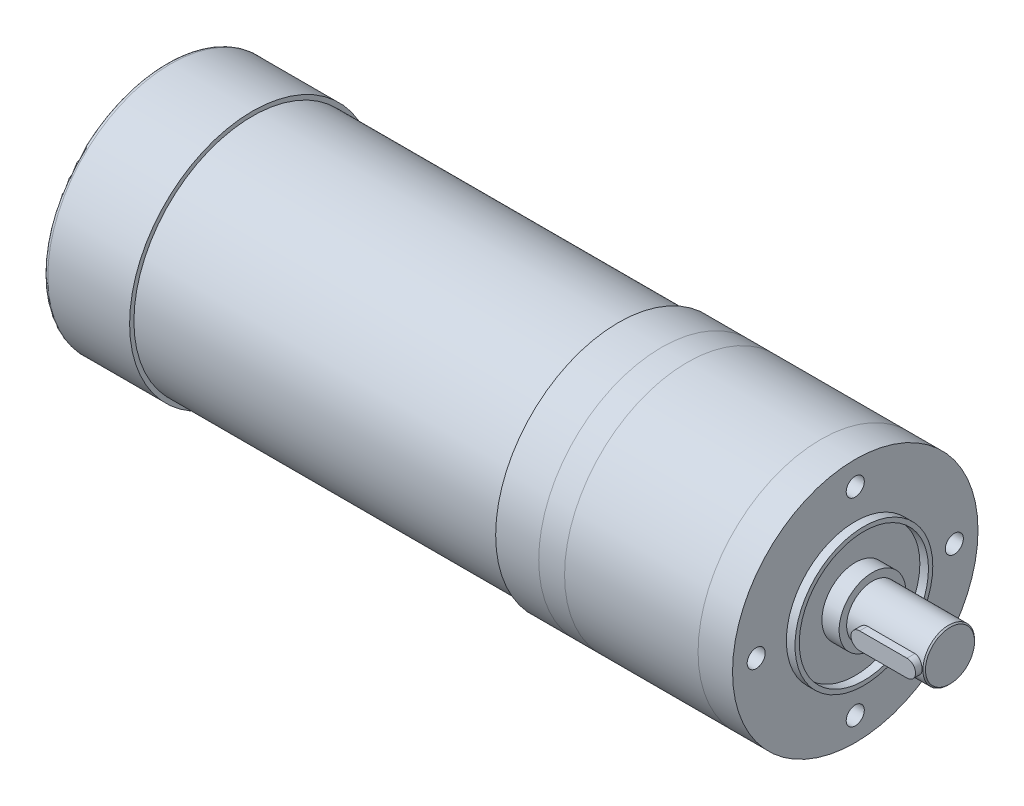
ISO-10303-21;
HEADER;
FILE_DESCRIPTION(('STEP AP214'),'2;1');
FILE_NAME('part.step','',(''),(''),'','','');
FILE_SCHEMA(('AUTOMOTIVE_DESIGN { 1 0 10303 214 1 1 1 1 }'));
ENDSEC;
DATA;
#1=APPLICATION_CONTEXT('core data for automotive mechanical design processes');
#2=APPLICATION_PROTOCOL_DEFINITION('international standard','automotive_design',2000,#1);
#3=PRODUCT_CONTEXT('',#1,'mechanical');
#4=PRODUCT('Part','Part','',(#3));
#5=PRODUCT_RELATED_PRODUCT_CATEGORY('part','',(#4));
#6=PRODUCT_DEFINITION_FORMATION('','',#4);
#7=PRODUCT_DEFINITION_CONTEXT('part definition',#1,'design');
#8=PRODUCT_DEFINITION('design','',#6,#7);
#9=PRODUCT_DEFINITION_SHAPE('','',#8);
#10=(LENGTH_UNIT() NAMED_UNIT(*) SI_UNIT(.MILLI.,.METRE.));
#11=(NAMED_UNIT(*) PLANE_ANGLE_UNIT() SI_UNIT($,.RADIAN.));
#12=(NAMED_UNIT(*) SI_UNIT($,.STERADIAN.) SOLID_ANGLE_UNIT());
#13=UNCERTAINTY_MEASURE_WITH_UNIT(LENGTH_MEASURE(1.E-05),#10,'distance_accuracy_value','');
#14=(GEOMETRIC_REPRESENTATION_CONTEXT(3) GLOBAL_UNCERTAINTY_ASSIGNED_CONTEXT((#13)) GLOBAL_UNIT_ASSIGNED_CONTEXT((#10,
#11,#12)) REPRESENTATION_CONTEXT('',''));
#15=CARTESIAN_POINT('',(0.,0.,0.));
#16=DIRECTION('',(0.,0.,1.));
#17=DIRECTION('',(1.,0.,0.));
#18=AXIS2_PLACEMENT_3D('',#15,#16,#17);
#19=CARTESIAN_POINT('',(8.5,0.,7.5));
#20=DIRECTION('',(0.,0.,-1.));
#21=DIRECTION('',(-1.,0.,0.));
#22=AXIS2_PLACEMENT_3D('',#19,#20,#21);
#23=CYLINDRICAL_SURFACE('',#22,2.);
#24=CARTESIAN_POINT('',(8.5,0.,3.5));
#25=DIRECTION('',(0.,0.,1.));
#26=DIRECTION('',(1.,0.,0.));
#27=AXIS2_PLACEMENT_3D('',#24,#25,#26);
#28=CIRCLE('',#27,2.);
#29=CARTESIAN_POINT('',(8.5,2.,3.5));
#30=VERTEX_POINT('',#29);
#31=CARTESIAN_POINT('',(8.5,-2.,3.5));
#32=VERTEX_POINT('',#31);
#33=EDGE_CURVE('E111',#30,#32,#28,.T.);
#34=ORIENTED_EDGE('',*,*,#33,.T.);
#35=DIRECTION('',(0.,0.,-1.));
#36=VECTOR('',#35,1.);
#37=CARTESIAN_POINT('',(8.5,-2.,7.5));
#38=LINE('',#37,#36);
#39=CARTESIAN_POINT('',(8.5,-2.,7.5));
#40=VERTEX_POINT('',#39);
#41=EDGE_CURVE('E12',#40,#32,#38,.T.);
#42=ORIENTED_EDGE('',*,*,#41,.F.);
#43=CARTESIAN_POINT('',(8.5,0.,7.5));
#44=DIRECTION('',(0.,0.,1.));
#45=DIRECTION('',(1.,0.,0.));
#46=AXIS2_PLACEMENT_3D('',#43,#44,#45);
#47=CIRCLE('',#46,2.);
#48=CARTESIAN_POINT('',(8.5,2.,7.5));
#49=VERTEX_POINT('',#48);
#50=EDGE_CURVE('E99',#49,#40,#47,.T.);
#51=ORIENTED_EDGE('',*,*,#50,.F.);
#52=DIRECTION('',(0.,0.,-1.));
#53=VECTOR('',#52,1.);
#54=CARTESIAN_POINT('',(8.5,2.,7.5));
#55=LINE('',#54,#53);
#56=EDGE_CURVE('E107',#49,#30,#55,.T.);
#57=ORIENTED_EDGE('',*,*,#56,.T.);
#58=EDGE_LOOP('',(#34,#42,#51,#57));
#59=FACE_BOUND('',#58,.T.);
#60=ADVANCED_FACE('F48',(#59),#23,.T.);
#61=CARTESIAN_POINT('',(19.5,-2.,7.5));
#62=DIRECTION('',(0.,1.,0.));
#63=DIRECTION('',(-1.,0.,0.));
#64=AXIS2_PLACEMENT_3D('',#61,#62,#63);
#65=PLANE('',#64);
#66=DIRECTION('',(1.,0.,0.));
#67=VECTOR('',#66,1.);
#68=CARTESIAN_POINT('',(19.5,-2.,3.5));
#69=LINE('',#68,#67);
#70=CARTESIAN_POINT('',(19.5,-2.,3.5));
#71=VERTEX_POINT('',#70);
#72=EDGE_CURVE('E103',#32,#71,#69,.T.);
#73=ORIENTED_EDGE('',*,*,#72,.T.);
#74=DIRECTION('',(0.,0.,-1.));
#75=VECTOR('',#74,1.);
#76=CARTESIAN_POINT('',(19.5,-2.,7.5));
#77=LINE('',#76,#75);
#78=CARTESIAN_POINT('',(19.5,-2.,7.5));
#79=VERTEX_POINT('',#78);
#80=EDGE_CURVE('E56',#79,#71,#77,.T.);
#81=ORIENTED_EDGE('',*,*,#80,.F.);
#82=DIRECTION('',(1.,0.,0.));
#83=VECTOR('',#82,1.);
#84=CARTESIAN_POINT('',(19.5,-2.,7.5));
#85=LINE('',#84,#83);
#86=EDGE_CURVE('E94',#40,#79,#85,.T.);
#87=ORIENTED_EDGE('',*,*,#86,.F.);
#88=ORIENTED_EDGE('',*,*,#41,.T.);
#89=EDGE_LOOP('',(#73,#81,#87,#88));
#90=FACE_BOUND('',#89,.T.);
#91=ADVANCED_FACE('F102',(#90),#65,.F.);
#92=CARTESIAN_POINT('',(19.5,0.,7.5));
#93=DIRECTION('',(0.,0.,-1.));
#94=DIRECTION('',(-1.,0.,0.));
#95=AXIS2_PLACEMENT_3D('',#92,#93,#94);
#96=CYLINDRICAL_SURFACE('',#95,2.);
#97=CARTESIAN_POINT('',(19.5,0.,3.5));
#98=DIRECTION('',(0.,0.,1.));
#99=DIRECTION('',(1.,0.,0.));
#100=AXIS2_PLACEMENT_3D('',#97,#98,#99);
#101=CIRCLE('',#100,2.);
#102=CARTESIAN_POINT('',(19.5,2.,3.5));
#103=VERTEX_POINT('',#102);
#104=EDGE_CURVE('E81',#71,#103,#101,.T.);
#105=ORIENTED_EDGE('',*,*,#104,.T.);
#106=DIRECTION('',(0.,0.,-1.));
#107=VECTOR('',#106,1.);
#108=CARTESIAN_POINT('',(19.5,2.,7.5));
#109=LINE('',#108,#107);
#110=CARTESIAN_POINT('',(19.5,2.,7.5));
#111=VERTEX_POINT('',#110);
#112=EDGE_CURVE('E104',#111,#103,#109,.T.);
#113=ORIENTED_EDGE('',*,*,#112,.F.);
#114=CARTESIAN_POINT('',(19.5,0.,7.5));
#115=DIRECTION('',(0.,0.,1.));
#116=DIRECTION('',(1.,0.,0.));
#117=AXIS2_PLACEMENT_3D('',#114,#115,#116);
#118=CIRCLE('',#117,2.);
#119=EDGE_CURVE('E97',#79,#111,#118,.T.);
#120=ORIENTED_EDGE('',*,*,#119,.F.);
#121=ORIENTED_EDGE('',*,*,#80,.T.);
#122=EDGE_LOOP('',(#105,#113,#120,#121));
#123=FACE_BOUND('',#122,.T.);
#124=ADVANCED_FACE('F105',(#123),#96,.T.);
#125=CARTESIAN_POINT('',(8.5,2.,7.5));
#126=DIRECTION('',(0.,-1.,0.));
#127=DIRECTION('',(1.,0.,0.));
#128=AXIS2_PLACEMENT_3D('',#125,#126,#127);
#129=PLANE('',#128);
#130=DIRECTION('',(-1.,0.,0.));
#131=VECTOR('',#130,1.);
#132=CARTESIAN_POINT('',(8.5,2.,3.5));
#133=LINE('',#132,#131);
#134=EDGE_CURVE('E87',#103,#30,#133,.T.);
#135=ORIENTED_EDGE('',*,*,#134,.T.);
#136=ORIENTED_EDGE('',*,*,#56,.F.);
#137=DIRECTION('',(-1.,0.,0.));
#138=VECTOR('',#137,1.);
#139=CARTESIAN_POINT('',(8.5,2.,7.5));
#140=LINE('',#139,#138);
#141=EDGE_CURVE('E64',#111,#49,#140,.T.);
#142=ORIENTED_EDGE('',*,*,#141,.F.);
#143=ORIENTED_EDGE('',*,*,#112,.T.);
#144=EDGE_LOOP('',(#135,#136,#142,#143));
#145=FACE_BOUND('',#144,.T.);
#146=ADVANCED_FACE('F118',(#145),#129,.F.);
#147=CARTESIAN_POINT('',(8.5,0.,7.5));
#148=DIRECTION('',(0.,0.,1.));
#149=DIRECTION('',(1.,0.,0.));
#150=AXIS2_PLACEMENT_3D('',#147,#148,#149);
#151=PLANE('',#150);
#152=ORIENTED_EDGE('',*,*,#50,.T.);
#153=ORIENTED_EDGE('',*,*,#86,.T.);
#154=ORIENTED_EDGE('',*,*,#119,.T.);
#155=ORIENTED_EDGE('',*,*,#141,.T.);
#156=EDGE_LOOP('',(#152,#153,#154,#155));
#157=FACE_BOUND('',#156,.T.);
#158=ADVANCED_FACE('F95',(#157),#151,.T.);
#159=CARTESIAN_POINT('',(8.5,0.,3.5));
#160=DIRECTION('',(0.,0.,1.));
#161=DIRECTION('',(1.,0.,0.));
#162=AXIS2_PLACEMENT_3D('',#159,#160,#161);
#163=PLANE('',#162);
#164=ORIENTED_EDGE('',*,*,#33,.F.);
#165=ORIENTED_EDGE('',*,*,#134,.F.);
#166=ORIENTED_EDGE('',*,*,#104,.F.);
#167=ORIENTED_EDGE('',*,*,#72,.F.);
#168=EDGE_LOOP('',(#164,#165,#166,#167));
#169=FACE_BOUND('',#168,.T.);
#170=ADVANCED_FACE('F121',(#169),#163,.F.);
#171=CLOSED_SHELL('',(#60,#91,#124,#146,#158,#170));
#172=MANIFOLD_SOLID_BREP('B2',#171);
#173=CARTESIAN_POINT('',(-55.,0.,0.));
#174=DIRECTION('',(-1.,0.,0.));
#175=DIRECTION('',(0.,0.,1.));
#176=AXIS2_PLACEMENT_3D('',#173,#174,#175);
#177=PLANE('',#176);
#178=CARTESIAN_POINT('',(-55.,0.,0.));
#179=DIRECTION('',(-1.,0.,0.));
#180=DIRECTION('',(0.,0.,1.));
#181=AXIS2_PLACEMENT_3D('',#178,#179,#180);
#182=CIRCLE('',#181,28.5);
#183=CARTESIAN_POINT('',(-55.,0.,28.5));
#184=VERTEX_POINT('',#183);
#185=EDGE_CURVE('E191',#184,#184,#182,.T.);
#186=ORIENTED_EDGE('',*,*,#185,.T.);
#187=EDGE_LOOP('',(#186));
#188=FACE_BOUND('',#187,.T.);
#189=CARTESIAN_POINT('',(-55.,0.,0.));
#190=DIRECTION('',(-1.,0.,0.));
#191=DIRECTION('',(0.,0.,1.));
#192=AXIS2_PLACEMENT_3D('',#189,#190,#191);
#193=CIRCLE('',#192,27.5);
#194=CARTESIAN_POINT('',(-55.,0.,27.5));
#195=VERTEX_POINT('',#194);
#196=EDGE_CURVE('E201',#195,#195,#193,.T.);
#197=ORIENTED_EDGE('',*,*,#196,.F.);
#198=EDGE_LOOP('',(#197));
#199=FACE_BOUND('',#198,.T.);
#200=ADVANCED_FACE('F180',(#188,#199),#177,.T.);
#201=CARTESIAN_POINT('',(-55.,0.,0.));
#202=DIRECTION('',(1.,0.,0.));
#203=DIRECTION('',(0.,0.,-1.));
#204=AXIS2_PLACEMENT_3D('',#201,#202,#203);
#205=CYLINDRICAL_SURFACE('',#204,28.5);
#206=ORIENTED_EDGE('',*,*,#185,.F.);
#207=EDGE_LOOP('',(#206));
#208=FACE_BOUND('',#207,.T.);
#209=CARTESIAN_POINT('',(-45.,0.,0.));
#210=DIRECTION('',(-1.,0.,0.));
#211=DIRECTION('',(0.,0.,1.));
#212=AXIS2_PLACEMENT_3D('',#209,#210,#211);
#213=CIRCLE('',#212,28.5);
#214=CARTESIAN_POINT('',(-45.,0.,28.5));
#215=VERTEX_POINT('',#214);
#216=EDGE_CURVE('E195',#215,#215,#213,.T.);
#217=ORIENTED_EDGE('',*,*,#216,.T.);
#218=EDGE_LOOP('',(#217));
#219=FACE_BOUND('',#218,.T.);
#220=ADVANCED_FACE('F226',(#208,#219),#205,.T.);
#221=CARTESIAN_POINT('',(-45.,0.,0.));
#222=DIRECTION('',(-1.,0.,0.));
#223=DIRECTION('',(0.,0.,1.));
#224=AXIS2_PLACEMENT_3D('',#221,#222,#223);
#225=PLANE('',#224);
#226=ORIENTED_EDGE('',*,*,#216,.F.);
#227=EDGE_LOOP('',(#226));
#228=FACE_BOUND('',#227,.T.);
#229=ADVANCED_FACE('F221',(#228),#225,.F.);
#230=CARTESIAN_POINT('',(-140.,0.,0.));
#231=DIRECTION('',(1.,0.,0.));
#232=DIRECTION('',(0.,0.,-1.));
#233=AXIS2_PLACEMENT_3D('',#230,#231,#232);
#234=CYLINDRICAL_SURFACE('',#233,27.5);
#235=CARTESIAN_POINT('',(-140.,0.,0.));
#236=DIRECTION('',(-1.,0.,0.));
#237=DIRECTION('',(0.,0.,1.));
#238=AXIS2_PLACEMENT_3D('',#235,#236,#237);
#239=CIRCLE('',#238,27.5);
#240=CARTESIAN_POINT('',(-140.,0.,27.5));
#241=VERTEX_POINT('',#240);
#242=EDGE_CURVE('E199',#241,#241,#239,.T.);
#243=ORIENTED_EDGE('',*,*,#242,.F.);
#244=EDGE_LOOP('',(#243));
#245=FACE_BOUND('',#244,.T.);
#246=ORIENTED_EDGE('',*,*,#196,.T.);
#247=EDGE_LOOP('',(#246));
#248=FACE_BOUND('',#247,.T.);
#249=ADVANCED_FACE('F215',(#245,#248),#234,.T.);
#250=CARTESIAN_POINT('',(-140.,0.,0.));
#251=DIRECTION('',(-1.,0.,0.));
#252=DIRECTION('',(0.,0.,1.));
#253=AXIS2_PLACEMENT_3D('',#250,#251,#252);
#254=PLANE('',#253);
#255=CARTESIAN_POINT('',(-140.,0.,0.));
#256=DIRECTION('',(-1.,0.,0.));
#257=DIRECTION('',(0.,0.,1.));
#258=AXIS2_PLACEMENT_3D('',#255,#256,#257);
#259=CIRCLE('',#258,28.5);
#260=CARTESIAN_POINT('',(-140.,0.,28.5));
#261=VERTEX_POINT('',#260);
#262=EDGE_CURVE('E204',#261,#261,#259,.T.);
#263=ORIENTED_EDGE('',*,*,#262,.F.);
#264=EDGE_LOOP('',(#263));
#265=FACE_BOUND('',#264,.T.);
#266=ORIENTED_EDGE('',*,*,#242,.T.);
#267=EDGE_LOOP('',(#266));
#268=FACE_BOUND('',#267,.T.);
#269=ADVANCED_FACE('F212',(#265,#268),#254,.F.);
#270=CARTESIAN_POINT('',(-160.,0.,0.));
#271=DIRECTION('',(1.,0.,0.));
#272=DIRECTION('',(0.,0.,-1.));
#273=AXIS2_PLACEMENT_3D('',#270,#271,#272);
#274=CYLINDRICAL_SURFACE('',#273,28.5);
#275=CARTESIAN_POINT('',(-159.,0.,0.));
#276=DIRECTION('',(-1.,0.,0.));
#277=DIRECTION('',(0.,0.,1.));
#278=AXIS2_PLACEMENT_3D('',#275,#276,#277);
#279=CIRCLE('',#278,28.5);
#280=CARTESIAN_POINT('',(-159.,0.,28.5));
#281=VERTEX_POINT('',#280);
#282=EDGE_CURVE('E47',#281,#281,#279,.F.);
#283=ORIENTED_EDGE('',*,*,#282,.T.);
#284=EDGE_LOOP('',(#283));
#285=FACE_BOUND('',#284,.T.);
#286=ORIENTED_EDGE('',*,*,#262,.T.);
#287=EDGE_LOOP('',(#286));
#288=FACE_BOUND('',#287,.T.);
#289=ADVANCED_FACE('F210',(#285,#288),#274,.T.);
#290=CARTESIAN_POINT('',(-160.,0.,0.));
#291=DIRECTION('',(-1.,0.,0.));
#292=DIRECTION('',(0.,0.,1.));
#293=AXIS2_PLACEMENT_3D('',#290,#291,#292);
#294=PLANE('',#293);
#295=CARTESIAN_POINT('',(-160.,0.,0.));
#296=DIRECTION('',(-1.,0.,0.));
#297=DIRECTION('',(0.,0.,1.));
#298=AXIS2_PLACEMENT_3D('',#295,#296,#297);
#299=CIRCLE('',#298,27.5);
#300=CARTESIAN_POINT('',(-160.,0.,27.5));
#301=VERTEX_POINT('',#300);
#302=EDGE_CURVE('E187',#301,#301,#299,.T.);
#303=ORIENTED_EDGE('',*,*,#302,.T.);
#304=EDGE_LOOP('',(#303));
#305=FACE_BOUND('',#304,.T.);
#306=ADVANCED_FACE('F257',(#305),#294,.T.);
#307=CARTESIAN_POINT('',(-159.,0.,0.));
#308=DIRECTION('',(-1.,0.,0.));
#309=DIRECTION('',(0.,0.,1.));
#310=AXIS2_PLACEMENT_3D('',#307,#308,#309);
#311=TOROIDAL_SURFACE('',#310,27.5,1.);
#312=ORIENTED_EDGE('',*,*,#282,.F.);
#313=EDGE_LOOP('',(#312));
#314=FACE_BOUND('',#313,.T.);
#315=ORIENTED_EDGE('',*,*,#302,.F.);
#316=EDGE_LOOP('',(#315));
#317=FACE_BOUND('',#316,.T.);
#318=ADVANCED_FACE('F182',(#314,#317),#311,.T.);
#319=CLOSED_SHELL('',(#200,#220,#229,#249,#269,#289,#306,#318));
#320=MANIFOLD_SOLID_BREP('B6',#319);
#321=CARTESIAN_POINT('',(-45.,0.,0.));
#322=DIRECTION('',(1.,0.,0.));
#323=DIRECTION('',(0.,0.,-1.));
#324=AXIS2_PLACEMENT_3D('',#321,#322,#323);
#325=CYLINDRICAL_SURFACE('',#324,28.5);
#326=CARTESIAN_POINT('',(-45.,0.,0.));
#327=DIRECTION('',(-1.,0.,0.));
#328=DIRECTION('',(0.,0.,1.));
#329=AXIS2_PLACEMENT_3D('',#326,#327,#328);
#330=CIRCLE('',#329,28.5);
#331=CARTESIAN_POINT('',(-45.,0.,28.5));
#332=VERTEX_POINT('',#331);
#333=EDGE_CURVE('E179',#332,#332,#330,.T.);
#334=ORIENTED_EDGE('',*,*,#333,.F.);
#335=EDGE_LOOP('',(#334));
#336=FACE_BOUND('',#335,.T.);
#337=CARTESIAN_POINT('',(-39.,0.,0.));
#338=DIRECTION('',(-1.,0.,0.));
#339=DIRECTION('',(0.,0.,1.));
#340=AXIS2_PLACEMENT_3D('',#337,#338,#339);
#341=CIRCLE('',#340,28.5);
#342=CARTESIAN_POINT('',(-39.,0.,28.5));
#343=VERTEX_POINT('',#342);
#344=EDGE_CURVE('E309',#343,#343,#341,.T.);
#345=ORIENTED_EDGE('',*,*,#344,.T.);
#346=EDGE_LOOP('',(#345));
#347=FACE_BOUND('',#346,.T.);
#348=ADVANCED_FACE('F306',(#336,#347),#325,.T.);
#349=CARTESIAN_POINT('',(-45.,0.,0.));
#350=DIRECTION('',(-1.,0.,0.));
#351=DIRECTION('',(0.,0.,1.));
#352=AXIS2_PLACEMENT_3D('',#349,#350,#351);
#353=PLANE('',#352);
#354=ORIENTED_EDGE('',*,*,#333,.T.);
#355=EDGE_LOOP('',(#354));
#356=FACE_BOUND('',#355,.T.);
#357=ADVANCED_FACE('F321',(#356),#353,.T.);
#358=CARTESIAN_POINT('',(-39.,0.,0.));
#359=DIRECTION('',(-1.,0.,0.));
#360=DIRECTION('',(0.,0.,1.));
#361=AXIS2_PLACEMENT_3D('',#358,#359,#360);
#362=PLANE('',#361);
#363=ORIENTED_EDGE('',*,*,#344,.F.);
#364=EDGE_LOOP('',(#363));
#365=FACE_BOUND('',#364,.T.);
#366=ADVANCED_FACE('F319',(#365),#362,.F.);
#367=CLOSED_SHELL('',(#348,#357,#366));
#368=MANIFOLD_SOLID_BREP('B42',#367);
#369=CARTESIAN_POINT('',(-39.,0.,0.));
#370=DIRECTION('',(1.,0.,0.));
#371=DIRECTION('',(0.,0.,-1.));
#372=AXIS2_PLACEMENT_3D('',#369,#370,#371);
#373=CYLINDRICAL_SURFACE('',#372,28.5);
#374=CARTESIAN_POINT('',(-39.,0.,0.));
#375=DIRECTION('',(-1.,0.,0.));
#376=DIRECTION('',(0.,0.,1.));
#377=AXIS2_PLACEMENT_3D('',#374,#375,#376);
#378=CIRCLE('',#377,28.5);
#379=CARTESIAN_POINT('',(-39.,0.,28.5));
#380=VERTEX_POINT('',#379);
#381=EDGE_CURVE('E304',#380,#380,#378,.T.);
#382=ORIENTED_EDGE('',*,*,#381,.F.);
#383=EDGE_LOOP('',(#382));
#384=FACE_BOUND('',#383,.T.);
#385=CARTESIAN_POINT('',(-8.,0.,0.));
#386=DIRECTION('',(-1.,0.,0.));
#387=DIRECTION('',(0.,0.,1.));
#388=AXIS2_PLACEMENT_3D('',#385,#386,#387);
#389=CIRCLE('',#388,28.5);
#390=CARTESIAN_POINT('',(-8.,0.,28.5));
#391=VERTEX_POINT('',#390);
#392=EDGE_CURVE('E364',#391,#391,#389,.T.);
#393=ORIENTED_EDGE('',*,*,#392,.T.);
#394=EDGE_LOOP('',(#393));
#395=FACE_BOUND('',#394,.T.);
#396=ADVANCED_FACE('F356',(#384,#395),#373,.T.);
#397=CARTESIAN_POINT('',(-39.,0.,0.));
#398=DIRECTION('',(-1.,0.,0.));
#399=DIRECTION('',(0.,0.,1.));
#400=AXIS2_PLACEMENT_3D('',#397,#398,#399);
#401=PLANE('',#400);
#402=ORIENTED_EDGE('',*,*,#381,.T.);
#403=EDGE_LOOP('',(#402));
#404=FACE_BOUND('',#403,.T.);
#405=ADVANCED_FACE('F429',(#404),#401,.T.);
#406=CARTESIAN_POINT('',(-8.,0.,0.));
#407=DIRECTION('',(-1.,0.,0.));
#408=DIRECTION('',(0.,0.,1.));
#409=AXIS2_PLACEMENT_3D('',#406,#407,#408);
#410=PLANE('',#409);
#411=CARTESIAN_POINT('',(-8.,23.,0.));
#412=DIRECTION('',(-1.,0.,0.));
#413=DIRECTION('',(0.,0.,1.));
#414=AXIS2_PLACEMENT_3D('',#411,#412,#413);
#415=CIRCLE('',#414,2.1);
#416=CARTESIAN_POINT('',(-8.,23.,2.1));
#417=VERTEX_POINT('',#416);
#418=EDGE_CURVE('E359',#417,#417,#415,.T.);
#419=ORIENTED_EDGE('',*,*,#418,.T.);
#420=EDGE_LOOP('',(#419));
#421=FACE_BOUND('',#420,.T.);
#422=CARTESIAN_POINT('',(-8.,0.,-23.));
#423=DIRECTION('',(-1.,0.,0.));
#424=DIRECTION('',(0.,0.,1.));
#425=AXIS2_PLACEMENT_3D('',#422,#423,#424);
#426=CIRCLE('',#425,2.1);
#427=CARTESIAN_POINT('',(-8.,0.,-20.9));
#428=VERTEX_POINT('',#427);
#429=EDGE_CURVE('E393',#428,#428,#426,.T.);
#430=ORIENTED_EDGE('',*,*,#429,.T.);
#431=EDGE_LOOP('',(#430));
#432=FACE_BOUND('',#431,.T.);
#433=CARTESIAN_POINT('',(-8.,-23.,0.));
#434=DIRECTION('',(-1.,0.,0.));
#435=DIRECTION('',(0.,0.,1.));
#436=AXIS2_PLACEMENT_3D('',#433,#434,#435);
#437=CIRCLE('',#436,2.1);
#438=CARTESIAN_POINT('',(-8.,-23.,2.1));
#439=VERTEX_POINT('',#438);
#440=EDGE_CURVE('E397',#439,#439,#437,.T.);
#441=ORIENTED_EDGE('',*,*,#440,.T.);
#442=EDGE_LOOP('',(#441));
#443=FACE_BOUND('',#442,.T.);
#444=CARTESIAN_POINT('',(-8.,0.,23.));
#445=DIRECTION('',(-1.,0.,0.));
#446=DIRECTION('',(0.,0.,1.));
#447=AXIS2_PLACEMENT_3D('',#444,#445,#446);
#448=CIRCLE('',#447,2.1);
#449=CARTESIAN_POINT('',(-8.,0.,25.1));
#450=VERTEX_POINT('',#449);
#451=EDGE_CURVE('E400',#450,#450,#448,.T.);
#452=ORIENTED_EDGE('',*,*,#451,.T.);
#453=EDGE_LOOP('',(#452));
#454=FACE_BOUND('',#453,.T.);
#455=ORIENTED_EDGE('',*,*,#392,.F.);
#456=EDGE_LOOP('',(#455));
#457=FACE_BOUND('',#456,.T.);
#458=ADVANCED_FACE('F410',(#421,#432,#443,#454,#457),#410,.F.);
#459=CARTESIAN_POINT('',(0.,0.,23.));
#460=DIRECTION('',(1.,0.,0.));
#461=DIRECTION('',(0.,0.,-1.));
#462=AXIS2_PLACEMENT_3D('',#459,#460,#461);
#463=CYLINDRICAL_SURFACE('',#462,2.1);
#464=CARTESIAN_POINT('',(-14.,0.,23.));
#465=DIRECTION('',(1.,0.,0.));
#466=DIRECTION('',(0.,0.,-1.));
#467=AXIS2_PLACEMENT_3D('',#464,#465,#466);
#468=CIRCLE('',#467,2.1);
#469=CARTESIAN_POINT('',(-14.,0.,20.9));
#470=VERTEX_POINT('',#469);
#471=EDGE_CURVE('E398',#470,#470,#468,.T.);
#472=ORIENTED_EDGE('',*,*,#471,.F.);
#473=EDGE_LOOP('',(#472));
#474=FACE_BOUND('',#473,.T.);
#475=ORIENTED_EDGE('',*,*,#451,.F.);
#476=EDGE_LOOP('',(#475));
#477=FACE_BOUND('',#476,.T.);
#478=ADVANCED_FACE('F441',(#474,#477),#463,.F.);
#479=CARTESIAN_POINT('',(-14.,0.,23.));
#480=DIRECTION('',(1.,0.,0.));
#481=DIRECTION('',(0.,0.,-1.));
#482=AXIS2_PLACEMENT_3D('',#479,#480,#481);
#483=CONICAL_SURFACE('',#482,2.1,1.02974425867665);
#484=CARTESIAN_POINT('',(-15.2618072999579,0.,23.));
#485=VERTEX_POINT('',#484);
#486=VERTEX_LOOP('',#485);
#487=FACE_BOUND('',#486,.T.);
#488=ORIENTED_EDGE('',*,*,#471,.T.);
#489=EDGE_LOOP('',(#488));
#490=FACE_BOUND('',#489,.T.);
#491=ADVANCED_FACE('F446',(#487,#490),#483,.F.);
#492=CARTESIAN_POINT('',(0.,-23.,0.));
#493=DIRECTION('',(1.,0.,0.));
#494=DIRECTION('',(0.,0.,-1.));
#495=AXIS2_PLACEMENT_3D('',#492,#493,#494);
#496=CYLINDRICAL_SURFACE('',#495,2.1);
#497=CARTESIAN_POINT('',(-14.,-23.,0.));
#498=DIRECTION('',(1.,0.,0.));
#499=DIRECTION('',(0.,0.,-1.));
#500=AXIS2_PLACEMENT_3D('',#497,#498,#499);
#501=CIRCLE('',#500,2.1);
#502=CARTESIAN_POINT('',(-14.,-23.,-2.1));
#503=VERTEX_POINT('',#502);
#504=EDGE_CURVE('E394',#503,#503,#501,.T.);
#505=ORIENTED_EDGE('',*,*,#504,.F.);
#506=EDGE_LOOP('',(#505));
#507=FACE_BOUND('',#506,.T.);
#508=ORIENTED_EDGE('',*,*,#440,.F.);
#509=EDGE_LOOP('',(#508));
#510=FACE_BOUND('',#509,.T.);
#511=ADVANCED_FACE('F425',(#507,#510),#496,.F.);
#512=CARTESIAN_POINT('',(-14.,-23.,0.));
#513=DIRECTION('',(1.,0.,0.));
#514=DIRECTION('',(0.,0.,-1.));
#515=AXIS2_PLACEMENT_3D('',#512,#513,#514);
#516=CONICAL_SURFACE('',#515,2.1,1.02974425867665);
#517=CARTESIAN_POINT('',(-15.2618072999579,-23.,0.));
#518=VERTEX_POINT('',#517);
#519=VERTEX_LOOP('',#518);
#520=FACE_BOUND('',#519,.T.);
#521=ORIENTED_EDGE('',*,*,#504,.T.);
#522=EDGE_LOOP('',(#521));
#523=FACE_BOUND('',#522,.T.);
#524=ADVANCED_FACE('F416',(#520,#523),#516,.F.);
#525=CARTESIAN_POINT('',(0.,0.,-23.));
#526=DIRECTION('',(1.,0.,0.));
#527=DIRECTION('',(0.,0.,-1.));
#528=AXIS2_PLACEMENT_3D('',#525,#526,#527);
#529=CYLINDRICAL_SURFACE('',#528,2.1);
#530=CARTESIAN_POINT('',(-14.,0.,-23.));
#531=DIRECTION('',(1.,0.,0.));
#532=DIRECTION('',(0.,0.,-1.));
#533=AXIS2_PLACEMENT_3D('',#530,#531,#532);
#534=CIRCLE('',#533,2.1);
#535=CARTESIAN_POINT('',(-14.,0.,-25.1));
#536=VERTEX_POINT('',#535);
#537=EDGE_CURVE('E389',#536,#536,#534,.T.);
#538=ORIENTED_EDGE('',*,*,#537,.F.);
#539=EDGE_LOOP('',(#538));
#540=FACE_BOUND('',#539,.T.);
#541=ORIENTED_EDGE('',*,*,#429,.F.);
#542=EDGE_LOOP('',(#541));
#543=FACE_BOUND('',#542,.T.);
#544=ADVANCED_FACE('F413',(#540,#543),#529,.F.);
#545=CARTESIAN_POINT('',(-14.,0.,-23.));
#546=DIRECTION('',(1.,0.,0.));
#547=DIRECTION('',(0.,0.,-1.));
#548=AXIS2_PLACEMENT_3D('',#545,#546,#547);
#549=CONICAL_SURFACE('',#548,2.1,1.02974425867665);
#550=CARTESIAN_POINT('',(-15.2618072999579,0.,-23.));
#551=VERTEX_POINT('',#550);
#552=VERTEX_LOOP('',#551);
#553=FACE_BOUND('',#552,.T.);
#554=ORIENTED_EDGE('',*,*,#537,.T.);
#555=EDGE_LOOP('',(#554));
#556=FACE_BOUND('',#555,.T.);
#557=ADVANCED_FACE('F415',(#553,#556),#549,.F.);
#558=CARTESIAN_POINT('',(0.,23.,0.));
#559=DIRECTION('',(1.,0.,0.));
#560=DIRECTION('',(0.,0.,-1.));
#561=AXIS2_PLACEMENT_3D('',#558,#559,#560);
#562=CYLINDRICAL_SURFACE('',#561,2.1);
#563=CARTESIAN_POINT('',(-14.,23.,0.));
#564=DIRECTION('',(1.,0.,0.));
#565=DIRECTION('',(0.,0.,-1.));
#566=AXIS2_PLACEMENT_3D('',#563,#564,#565);
#567=CIRCLE('',#566,2.1);
#568=CARTESIAN_POINT('',(-14.,23.,-2.1));
#569=VERTEX_POINT('',#568);
#570=EDGE_CURVE('E385',#569,#569,#567,.T.);
#571=ORIENTED_EDGE('',*,*,#570,.F.);
#572=EDGE_LOOP('',(#571));
#573=FACE_BOUND('',#572,.T.);
#574=ORIENTED_EDGE('',*,*,#418,.F.);
#575=EDGE_LOOP('',(#574));
#576=FACE_BOUND('',#575,.T.);
#577=ADVANCED_FACE('F381',(#573,#576),#562,.F.);
#578=CARTESIAN_POINT('',(-14.,23.,0.));
#579=DIRECTION('',(1.,0.,0.));
#580=DIRECTION('',(0.,0.,-1.));
#581=AXIS2_PLACEMENT_3D('',#578,#579,#580);
#582=CONICAL_SURFACE('',#581,2.1,1.02974425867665);
#583=CARTESIAN_POINT('',(-15.2618072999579,23.,0.));
#584=VERTEX_POINT('',#583);
#585=VERTEX_LOOP('',#584);
#586=FACE_BOUND('',#585,.T.);
#587=ORIENTED_EDGE('',*,*,#570,.T.);
#588=EDGE_LOOP('',(#587));
#589=FACE_BOUND('',#588,.T.);
#590=ADVANCED_FACE('F378',(#586,#589),#582,.F.);
#591=CLOSED_SHELL('',(#396,#405,#458,#478,#491,#511,#524,#544,#557,#577,#590));
#592=MANIFOLD_SOLID_BREP('B174',#591);
#593=CARTESIAN_POINT('',(4.,0.,0.));
#594=DIRECTION('',(1.,0.,0.));
#595=DIRECTION('',(0.,0.,-1.));
#596=AXIS2_PLACEMENT_3D('',#593,#594,#595);
#597=PLANE('',#596);
#598=CARTESIAN_POINT('',(4.,0.,0.));
#599=DIRECTION('',(1.,0.,0.));
#600=DIRECTION('',(0.,0.,-1.));
#601=AXIS2_PLACEMENT_3D('',#598,#599,#600);
#602=CIRCLE('',#601,7.75);
#603=CARTESIAN_POINT('',(4.,0.,-7.75));
#604=VERTEX_POINT('',#603);
#605=EDGE_CURVE('E646',#604,#604,#602,.T.);
#606=ORIENTED_EDGE('',*,*,#605,.T.);
#607=EDGE_LOOP('',(#606));
#608=FACE_BOUND('',#607,.T.);
#609=CARTESIAN_POINT('',(4.,0.,0.));
#610=DIRECTION('',(1.,0.,0.));
#611=DIRECTION('',(0.,0.,-1.));
#612=AXIS2_PLACEMENT_3D('',#609,#610,#611);
#613=CIRCLE('',#612,6.);
#614=CARTESIAN_POINT('',(4.,0.,-6.));
#615=VERTEX_POINT('',#614);
#616=EDGE_CURVE('E642',#615,#615,#613,.T.);
#617=ORIENTED_EDGE('',*,*,#616,.F.);
#618=EDGE_LOOP('',(#617));
#619=FACE_BOUND('',#618,.T.);
#620=ADVANCED_FACE('F547',(#608,#619),#597,.T.);
#621=CARTESIAN_POINT('',(0.,0.,0.));
#622=DIRECTION('',(1.,0.,0.));
#623=DIRECTION('',(0.,0.,-1.));
#624=AXIS2_PLACEMENT_3D('',#621,#622,#623);
#625=PLANE('',#624);
#626=CARTESIAN_POINT('',(0.,0.,0.));
#627=DIRECTION('',(1.,0.,0.));
#628=DIRECTION('',(0.,0.,-1.));
#629=AXIS2_PLACEMENT_3D('',#626,#627,#628);
#630=CIRCLE('',#629,15.);
#631=CARTESIAN_POINT('',(0.,0.,-15.));
#632=VERTEX_POINT('',#631);
#633=EDGE_CURVE('E664',#632,#632,#630,.F.);
#634=ORIENTED_EDGE('',*,*,#633,.F.);
#635=EDGE_LOOP('',(#634));
#636=FACE_BOUND('',#635,.T.);
#637=CARTESIAN_POINT('',(0.,0.,0.));
#638=DIRECTION('',(1.,0.,0.));
#639=DIRECTION('',(0.,0.,-1.));
#640=AXIS2_PLACEMENT_3D('',#637,#638,#639);
#641=CIRCLE('',#640,7.75);
#642=CARTESIAN_POINT('',(0.,0.,-7.75));
#643=VERTEX_POINT('',#642);
#644=EDGE_CURVE('E645',#643,#643,#641,.T.);
#645=ORIENTED_EDGE('',*,*,#644,.F.);
#646=EDGE_LOOP('',(#645));
#647=FACE_BOUND('',#646,.T.);
#648=ADVANCED_FACE('F723',(#636,#647),#625,.T.);
#649=CARTESIAN_POINT('',(0.,23.,0.));
#650=DIRECTION('',(1.,0.,0.));
#651=DIRECTION('',(0.,0.,-1.));
#652=AXIS2_PLACEMENT_3D('',#649,#650,#651);
#653=CIRCLE('',#652,2.1);
#654=CARTESIAN_POINT('',(0.,23.,-2.1));
#655=VERTEX_POINT('',#654);
#656=EDGE_CURVE('E615',#655,#655,#653,.T.);
#657=ORIENTED_EDGE('',*,*,#656,.F.);
#658=EDGE_LOOP('',(#657));
#659=FACE_BOUND('',#658,.T.);
#660=CARTESIAN_POINT('',(0.,0.,-23.));
#661=DIRECTION('',(1.,0.,0.));
#662=DIRECTION('',(0.,0.,-1.));
#663=AXIS2_PLACEMENT_3D('',#660,#661,#662);
#664=CIRCLE('',#663,2.1);
#665=CARTESIAN_POINT('',(0.,0.,-25.1));
#666=VERTEX_POINT('',#665);
#667=EDGE_CURVE('E624',#666,#666,#664,.T.);
#668=ORIENTED_EDGE('',*,*,#667,.F.);
#669=EDGE_LOOP('',(#668));
#670=FACE_BOUND('',#669,.T.);
#671=CARTESIAN_POINT('',(0.,-23.,0.));
#672=DIRECTION('',(1.,0.,0.));
#673=DIRECTION('',(0.,0.,-1.));
#674=AXIS2_PLACEMENT_3D('',#671,#672,#673);
#675=CIRCLE('',#674,2.1);
#676=CARTESIAN_POINT('',(0.,-23.,-2.1));
#677=VERTEX_POINT('',#676);
#678=EDGE_CURVE('E630',#677,#677,#675,.T.);
#679=ORIENTED_EDGE('',*,*,#678,.F.);
#680=EDGE_LOOP('',(#679));
#681=FACE_BOUND('',#680,.T.);
#682=CARTESIAN_POINT('',(0.,0.,23.));
#683=DIRECTION('',(1.,0.,0.));
#684=DIRECTION('',(0.,0.,-1.));
#685=AXIS2_PLACEMENT_3D('',#682,#683,#684);
#686=CIRCLE('',#685,2.1);
#687=CARTESIAN_POINT('',(0.,0.,20.9));
#688=VERTEX_POINT('',#687);
#689=EDGE_CURVE('E636',#688,#688,#686,.T.);
#690=ORIENTED_EDGE('',*,*,#689,.F.);
#691=EDGE_LOOP('',(#690));
#692=FACE_BOUND('',#691,.T.);
#693=CARTESIAN_POINT('',(0.,0.,0.));
#694=DIRECTION('',(1.,0.,0.));
#695=DIRECTION('',(0.,0.,-1.));
#696=AXIS2_PLACEMENT_3D('',#693,#694,#695);
#697=CIRCLE('',#696,28.5);
#698=CARTESIAN_POINT('',(0.,0.,-28.5));
#699=VERTEX_POINT('',#698);
#700=EDGE_CURVE('E658',#699,#699,#697,.T.);
#701=ORIENTED_EDGE('',*,*,#700,.T.);
#702=EDGE_LOOP('',(#701));
#703=FACE_BOUND('',#702,.T.);
#704=CARTESIAN_POINT('',(0.,0.,0.));
#705=DIRECTION('',(1.,0.,0.));
#706=DIRECTION('',(0.,0.,-1.));
#707=AXIS2_PLACEMENT_3D('',#704,#705,#706);
#708=CIRCLE('',#707,16.);
#709=CARTESIAN_POINT('',(0.,0.,-16.));
#710=VERTEX_POINT('',#709);
#711=EDGE_CURVE('E654',#710,#710,#708,.T.);
#712=ORIENTED_EDGE('',*,*,#711,.F.);
#713=EDGE_LOOP('',(#712));
#714=FACE_BOUND('',#713,.T.);
#715=ADVANCED_FACE('F728',(#659,#670,#681,#692,#703,#714),#625,.T.);
#716=CARTESIAN_POINT('',(-8.,0.,0.));
#717=DIRECTION('',(1.,0.,0.));
#718=DIRECTION('',(0.,0.,-1.));
#719=AXIS2_PLACEMENT_3D('',#716,#717,#718);
#720=CYLINDRICAL_SURFACE('',#719,28.5);
#721=CARTESIAN_POINT('',(-8.,0.,0.));
#722=DIRECTION('',(1.,0.,0.));
#723=DIRECTION('',(0.,0.,-1.));
#724=AXIS2_PLACEMENT_3D('',#721,#722,#723);
#725=CIRCLE('',#724,28.5);
#726=CARTESIAN_POINT('',(-8.,0.,-28.5));
#727=VERTEX_POINT('',#726);
#728=EDGE_CURVE('E661',#727,#727,#725,.T.);
#729=ORIENTED_EDGE('',*,*,#728,.T.);
#730=EDGE_LOOP('',(#729));
#731=FACE_BOUND('',#730,.T.);
#732=ORIENTED_EDGE('',*,*,#700,.F.);
#733=EDGE_LOOP('',(#732));
#734=FACE_BOUND('',#733,.T.);
#735=ADVANCED_FACE('F750',(#731,#734),#720,.T.);
#736=CARTESIAN_POINT('',(-8.,0.,0.));
#737=DIRECTION('',(1.,0.,0.));
#738=DIRECTION('',(0.,0.,-1.));
#739=AXIS2_PLACEMENT_3D('',#736,#737,#738);
#740=PLANE('',#739);
#741=CARTESIAN_POINT('',(-8.,23.,0.));
#742=DIRECTION('',(1.,0.,0.));
#743=DIRECTION('',(0.,0.,-1.));
#744=AXIS2_PLACEMENT_3D('',#741,#742,#743);
#745=CIRCLE('',#744,2.1);
#746=CARTESIAN_POINT('',(-8.,23.,-2.1));
#747=VERTEX_POINT('',#746);
#748=EDGE_CURVE('E621',#747,#747,#745,.T.);
#749=ORIENTED_EDGE('',*,*,#748,.T.);
#750=EDGE_LOOP('',(#749));
#751=FACE_BOUND('',#750,.T.);
#752=CARTESIAN_POINT('',(-8.,0.,-23.));
#753=DIRECTION('',(1.,0.,0.));
#754=DIRECTION('',(0.,0.,-1.));
#755=AXIS2_PLACEMENT_3D('',#752,#753,#754);
#756=CIRCLE('',#755,2.1);
#757=CARTESIAN_POINT('',(-8.,0.,-25.1));
#758=VERTEX_POINT('',#757);
#759=EDGE_CURVE('E627',#758,#758,#756,.T.);
#760=ORIENTED_EDGE('',*,*,#759,.T.);
#761=EDGE_LOOP('',(#760));
#762=FACE_BOUND('',#761,.T.);
#763=CARTESIAN_POINT('',(-8.,-23.,0.));
#764=DIRECTION('',(1.,0.,0.));
#765=DIRECTION('',(0.,0.,-1.));
#766=AXIS2_PLACEMENT_3D('',#763,#764,#765);
#767=CIRCLE('',#766,2.1);
#768=CARTESIAN_POINT('',(-8.,-23.,-2.1));
#769=VERTEX_POINT('',#768);
#770=EDGE_CURVE('E633',#769,#769,#767,.T.);
#771=ORIENTED_EDGE('',*,*,#770,.T.);
#772=EDGE_LOOP('',(#771));
#773=FACE_BOUND('',#772,.T.);
#774=CARTESIAN_POINT('',(-8.,0.,23.));
#775=DIRECTION('',(1.,0.,0.));
#776=DIRECTION('',(0.,0.,-1.));
#777=AXIS2_PLACEMENT_3D('',#774,#775,#776);
#778=CIRCLE('',#777,2.1);
#779=CARTESIAN_POINT('',(-8.,0.,20.9));
#780=VERTEX_POINT('',#779);
#781=EDGE_CURVE('E639',#780,#780,#778,.T.);
#782=ORIENTED_EDGE('',*,*,#781,.T.);
#783=EDGE_LOOP('',(#782));
#784=FACE_BOUND('',#783,.T.);
#785=ORIENTED_EDGE('',*,*,#728,.F.);
#786=EDGE_LOOP('',(#785));
#787=FACE_BOUND('',#786,.T.);
#788=ADVANCED_FACE('F744',(#751,#762,#773,#784,#787),#740,.F.);
#789=CARTESIAN_POINT('',(2.,0.,0.));
#790=DIRECTION('',(1.,0.,0.));
#791=DIRECTION('',(0.,0.,-1.));
#792=AXIS2_PLACEMENT_3D('',#789,#790,#791);
#793=PLANE('',#792);
#794=CARTESIAN_POINT('',(2.,0.,0.));
#795=DIRECTION('',(1.,0.,0.));
#796=DIRECTION('',(0.,0.,-1.));
#797=AXIS2_PLACEMENT_3D('',#794,#795,#796);
#798=CIRCLE('',#797,16.);
#799=CARTESIAN_POINT('',(2.,0.,-16.));
#800=VERTEX_POINT('',#799);
#801=EDGE_CURVE('E655',#800,#800,#798,.T.);
#802=ORIENTED_EDGE('',*,*,#801,.T.);
#803=EDGE_LOOP('',(#802));
#804=FACE_BOUND('',#803,.T.);
#805=CARTESIAN_POINT('',(2.,0.,0.));
#806=DIRECTION('',(1.,0.,0.));
#807=DIRECTION('',(0.,0.,-1.));
#808=AXIS2_PLACEMENT_3D('',#805,#806,#807);
#809=CIRCLE('',#808,15.);
#810=CARTESIAN_POINT('',(2.,0.,-15.));
#811=VERTEX_POINT('',#810);
#812=EDGE_CURVE('E649',#811,#811,#809,.T.);
#813=ORIENTED_EDGE('',*,*,#812,.F.);
#814=EDGE_LOOP('',(#813));
#815=FACE_BOUND('',#814,.T.);
#816=ADVANCED_FACE('F741',(#804,#815),#793,.T.);
#817=CARTESIAN_POINT('',(2.,0.,0.));
#818=DIRECTION('',(-1.,0.,0.));
#819=DIRECTION('',(0.,0.,1.));
#820=AXIS2_PLACEMENT_3D('',#817,#818,#819);
#821=CYLINDRICAL_SURFACE('',#820,16.);
#822=ORIENTED_EDGE('',*,*,#801,.F.);
#823=EDGE_LOOP('',(#822));
#824=FACE_BOUND('',#823,.T.);
#825=ORIENTED_EDGE('',*,*,#711,.T.);
#826=EDGE_LOOP('',(#825));
#827=FACE_BOUND('',#826,.T.);
#828=ADVANCED_FACE('F739',(#824,#827),#821,.T.);
#829=CARTESIAN_POINT('',(2.,0.,0.));
#830=DIRECTION('',(-1.,0.,0.));
#831=DIRECTION('',(0.,0.,1.));
#832=AXIS2_PLACEMENT_3D('',#829,#830,#831);
#833=CYLINDRICAL_SURFACE('',#832,15.);
#834=ORIENTED_EDGE('',*,*,#812,.T.);
#835=EDGE_LOOP('',(#834));
#836=FACE_BOUND('',#835,.T.);
#837=ORIENTED_EDGE('',*,*,#633,.T.);
#838=EDGE_LOOP('',(#837));
#839=FACE_BOUND('',#838,.T.);
#840=ADVANCED_FACE('F735',(#836,#839),#833,.F.);
#841=CARTESIAN_POINT('',(4.,0.,0.));
#842=DIRECTION('',(-1.,0.,0.));
#843=DIRECTION('',(0.,0.,1.));
#844=AXIS2_PLACEMENT_3D('',#841,#842,#843);
#845=CYLINDRICAL_SURFACE('',#844,7.75);
#846=ORIENTED_EDGE('',*,*,#605,.F.);
#847=EDGE_LOOP('',(#846));
#848=FACE_BOUND('',#847,.T.);
#849=ORIENTED_EDGE('',*,*,#644,.T.);
#850=EDGE_LOOP('',(#849));
#851=FACE_BOUND('',#850,.T.);
#852=ADVANCED_FACE('F719',(#848,#851),#845,.T.);
#853=CARTESIAN_POINT('',(22.,0.,0.));
#854=DIRECTION('',(-1.,0.,0.));
#855=DIRECTION('',(0.,0.,1.));
#856=AXIS2_PLACEMENT_3D('',#853,#854,#855);
#857=CYLINDRICAL_SURFACE('',#856,6.);
#858=CARTESIAN_POINT('',(21.7,0.,0.));
#859=DIRECTION('',(1.,0.,0.));
#860=DIRECTION('',(0.,0.,-1.));
#861=AXIS2_PLACEMENT_3D('',#858,#859,#860);
#862=CIRCLE('',#861,6.);
#863=CARTESIAN_POINT('',(21.7,0.,-6.));
#864=VERTEX_POINT('',#863);
#865=EDGE_CURVE('E354',#864,#864,#862,.F.);
#866=ORIENTED_EDGE('',*,*,#865,.T.);
#867=EDGE_LOOP('',(#866));
#868=FACE_BOUND('',#867,.T.);
#869=DIRECTION('',(-1.,0.,0.));
#870=VECTOR('',#869,1.);
#871=CARTESIAN_POINT('',(22.,2.,5.65685424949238));
#872=LINE('',#871,#870);
#873=CARTESIAN_POINT('',(8.5,2.,5.65685424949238));
#874=VERTEX_POINT('',#873);
#875=CARTESIAN_POINT('',(19.5,2.,5.65685424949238));
#876=VERTEX_POINT('',#875);
#877=EDGE_CURVE('E570',#874,#876,#872,.F.);
#878=ORIENTED_EDGE('',*,*,#877,.T.);
#879=CARTESIAN_POINT('',(19.5,2.,5.65685424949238));
#880=CARTESIAN_POINT('',(19.5545809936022,2.00000149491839,5.65684884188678));
#881=CARTESIAN_POINT('',(19.6091341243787,1.99776424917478,5.6576451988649));
#882=CARTESIAN_POINT('',(19.7178171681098,1.9888512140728,5.66078654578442));
#883=CARTESIAN_POINT('',(19.7719471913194,1.98217662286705,5.66313111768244));
#884=CARTESIAN_POINT('',(19.9327842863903,1.95562135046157,5.67238184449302));
#885=CARTESIAN_POINT('',(20.038361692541,1.92920846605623,5.6815058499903));
#886=CARTESIAN_POINT('',(20.2432503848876,1.85991682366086,5.70456149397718));
#887=CARTESIAN_POINT('',(20.3425650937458,1.81704715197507,5.71849047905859));
#888=CARTESIAN_POINT('',(20.5326796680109,1.71614645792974,5.74957574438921));
#889=CARTESIAN_POINT('',(20.6234742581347,1.65810612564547,5.76673400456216));
#890=CARTESIAN_POINT('',(20.7974404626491,1.52610278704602,5.80308960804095));
#891=CARTESIAN_POINT('',(20.8802297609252,1.45164996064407,5.82233755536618));
#892=CARTESIAN_POINT('',(21.0324120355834,1.28997688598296,5.86027697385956));
#893=CARTESIAN_POINT('',(21.1018026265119,1.20275436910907,5.87896834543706));
#894=CARTESIAN_POINT('',(21.2269590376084,1.01520729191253,5.91427765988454));
#895=CARTESIAN_POINT('',(21.2823219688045,0.914600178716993,5.93082875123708));
#896=CARTESIAN_POINT('',(21.3751845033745,0.704858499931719,5.95939217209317));
#897=CARTESIAN_POINT('',(21.4126895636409,0.595726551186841,5.97140588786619));
#898=CARTESIAN_POINT('',(21.4674714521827,0.376058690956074,5.98918142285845));
#899=CARTESIAN_POINT('',(21.4854065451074,0.265703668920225,5.99514617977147));
#900=CARTESIAN_POINT('',(21.5026325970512,0.0433979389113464,6.00087216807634));
#901=CARTESIAN_POINT('',(21.5019279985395,-0.0685523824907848,6.00063487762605));
#902=CARTESIAN_POINT('',(21.4823114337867,-0.286207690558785,5.99412077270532));
#903=CARTESIAN_POINT('',(21.4641147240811,-0.391985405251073,5.98808121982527));
#904=CARTESIAN_POINT('',(21.4112136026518,-0.598888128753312,5.97093921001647));
#905=CARTESIAN_POINT('',(21.3765082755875,-0.700012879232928,5.95983647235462));
#906=CARTESIAN_POINT('',(21.2911572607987,-0.896305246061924,5.93351336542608));
#907=CARTESIAN_POINT('',(21.2403079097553,-0.991377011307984,5.91824075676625));
#908=CARTESIAN_POINT('',(21.1242800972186,-1.17184917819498,5.88516775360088));
#909=CARTESIAN_POINT('',(21.059097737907,-1.25724693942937,5.86736667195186));
#910=CARTESIAN_POINT('',(20.9126579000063,-1.42019467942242,5.83012543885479));
#911=CARTESIAN_POINT('',(20.8307889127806,-1.4971872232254,5.81064757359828));
#912=CARTESIAN_POINT('',(20.6551170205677,-1.63654404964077,5.77294980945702));
#913=CARTESIAN_POINT('',(20.5613102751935,-1.69890360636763,5.75473031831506));
#914=CARTESIAN_POINT('',(20.3626396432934,-1.80800665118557,5.72140062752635));
#915=CARTESIAN_POINT('',(20.2576329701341,-1.85450601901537,5.70634029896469));
#916=CARTESIAN_POINT('',(20.0407060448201,-1.92892046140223,5.68162194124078));
#917=CARTESIAN_POINT('',(19.9287970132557,-1.95686487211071,5.67195538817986));
#918=CARTESIAN_POINT('',(19.763162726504,-1.98331631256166,5.6627308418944));
#919=CARTESIAN_POINT('',(19.7107172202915,-1.98957012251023,5.66053335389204));
#920=CARTESIAN_POINT('',(19.6055238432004,-1.99790923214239,5.65759407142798));
#921=CARTESIAN_POINT('',(19.5527764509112,-1.99999991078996,5.65685039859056));
#922=CARTESIAN_POINT('',(19.5,-2.,5.65685424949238));
#923=B_SPLINE_CURVE_WITH_KNOTS('',3,(#879,#880,#881,#882,#883,#884,#885,#886,#887,#888,#889,
#890,#891,#892,#893,#894,#895,#896,#897,#898,#899,#900,#901,#902,#903,#904,#905,#906,#907,#908,
#909,#910,#911,#912,#913,#914,#915,#916,#917,#918,#919,#920,#921,#922),.UNSPECIFIED.,.F.,.F.,(4,
2,2,2,2,2,2,2,2,2,2,2,2,2,2,2,2,2,2,2,2,4),(0.,0.163636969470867,0.327229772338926,
0.653162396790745,0.978915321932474,1.30486862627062,1.64233009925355,1.97985159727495,
2.32618265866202,2.67240782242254,3.00658941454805,3.34069136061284,3.6616883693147,
3.98270317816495,4.30794037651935,4.63326613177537,4.973881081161,5.31460588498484,
5.6603605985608,6.00556734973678,6.16399790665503,6.32222363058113),.UNSPECIFIED.);
#924=CARTESIAN_POINT('',(19.5,-2.,5.65685424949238));
#925=VERTEX_POINT('',#924);
#926=EDGE_CURVE('E669',#876,#925,#923,.T.);
#927=ORIENTED_EDGE('',*,*,#926,.T.);
#928=DIRECTION('',(-1.,0.,0.));
#929=VECTOR('',#928,1.);
#930=CARTESIAN_POINT('',(22.,-2.,5.65685424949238));
#931=LINE('',#930,#929);
#932=CARTESIAN_POINT('',(8.5,-2.,5.65685424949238));
#933=VERTEX_POINT('',#932);
#934=EDGE_CURVE('E893',#925,#933,#931,.T.);
#935=ORIENTED_EDGE('',*,*,#934,.T.);
#936=CARTESIAN_POINT('',(8.5,-2.,5.65685424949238));
#937=CARTESIAN_POINT('',(8.44541900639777,-2.0000014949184,5.65684884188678));
#938=CARTESIAN_POINT('',(8.39086587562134,-1.99776424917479,5.6576451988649));
#939=CARTESIAN_POINT('',(8.28218283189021,-1.9888512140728,5.66078654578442));
#940=CARTESIAN_POINT('',(8.22805280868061,-1.98217662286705,5.66313111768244));
#941=CARTESIAN_POINT('',(8.06721571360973,-1.95562135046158,5.67238184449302));
#942=CARTESIAN_POINT('',(7.96163830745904,-1.92920846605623,5.6815058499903));
#943=CARTESIAN_POINT('',(7.75674961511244,-1.85991682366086,5.70456149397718));
#944=CARTESIAN_POINT('',(7.65743490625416,-1.81704715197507,5.71849047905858));
#945=CARTESIAN_POINT('',(7.46732033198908,-1.71614645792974,5.74957574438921));
#946=CARTESIAN_POINT('',(7.37652574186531,-1.65810612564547,5.76673400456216));
#947=CARTESIAN_POINT('',(7.20255953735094,-1.52610278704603,5.80308960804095));
#948=CARTESIAN_POINT('',(7.11977023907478,-1.45164996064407,5.82233755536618));
#949=CARTESIAN_POINT('',(6.96758796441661,-1.28997688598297,5.86027697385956));
#950=CARTESIAN_POINT('',(6.89819737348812,-1.20275436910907,5.87896834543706));
#951=CARTESIAN_POINT('',(6.7730409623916,-1.01520729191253,5.91427765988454));
#952=CARTESIAN_POINT('',(6.71767803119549,-0.914600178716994,5.93082875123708));
#953=CARTESIAN_POINT('',(6.62481549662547,-0.704858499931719,5.95939217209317));
#954=CARTESIAN_POINT('',(6.58731043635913,-0.595726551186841,5.97140588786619));
#955=CARTESIAN_POINT('',(6.53252854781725,-0.376058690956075,5.98918142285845));
#956=CARTESIAN_POINT('',(6.51459345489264,-0.265703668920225,5.99514617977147));
#957=CARTESIAN_POINT('',(6.49736740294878,-0.0433979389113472,6.00087216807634));
#958=CARTESIAN_POINT('',(6.4980720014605,0.0685523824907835,6.00063487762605));
#959=CARTESIAN_POINT('',(6.51768856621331,0.286207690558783,5.99412077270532));
#960=CARTESIAN_POINT('',(6.53588527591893,0.391985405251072,5.98808121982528));
#961=CARTESIAN_POINT('',(6.58878639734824,0.598888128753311,5.97093921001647));
#962=CARTESIAN_POINT('',(6.62349172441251,0.700012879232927,5.95983647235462));
#963=CARTESIAN_POINT('',(6.70884273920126,0.896305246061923,5.93351336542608));
#964=CARTESIAN_POINT('',(6.75969209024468,0.991377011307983,5.91824075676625));
#965=CARTESIAN_POINT('',(6.8757199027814,1.17184917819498,5.88516775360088));
#966=CARTESIAN_POINT('',(6.94090226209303,1.25724693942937,5.86736667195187));
#967=CARTESIAN_POINT('',(7.08734209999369,1.42019467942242,5.83012543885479));
#968=CARTESIAN_POINT('',(7.16921108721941,1.4971872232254,5.81064757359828));
#969=CARTESIAN_POINT('',(7.34488297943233,1.63654404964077,5.77294980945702));
#970=CARTESIAN_POINT('',(7.43868972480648,1.69890360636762,5.75473031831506));
#971=CARTESIAN_POINT('',(7.63736035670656,1.80800665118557,5.72140062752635));
#972=CARTESIAN_POINT('',(7.74236702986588,1.85450601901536,5.70634029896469));
#973=CARTESIAN_POINT('',(7.95929395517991,1.92892046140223,5.68162194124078));
#974=CARTESIAN_POINT('',(8.0712029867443,1.95686487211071,5.67195538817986));
#975=CARTESIAN_POINT('',(8.23683727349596,1.98331631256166,5.6627308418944));
#976=CARTESIAN_POINT('',(8.28928277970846,1.98957012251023,5.66053335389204));
#977=CARTESIAN_POINT('',(8.39447615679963,1.99790923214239,5.65759407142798));
#978=CARTESIAN_POINT('',(8.44722354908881,1.99999991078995,5.65685039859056));
#979=CARTESIAN_POINT('',(8.5,2.,5.65685424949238));
#980=B_SPLINE_CURVE_WITH_KNOTS('',3,(#936,#937,#938,#939,#940,#941,#942,#943,#944,#945,#946,
#947,#948,#949,#950,#951,#952,#953,#954,#955,#956,#957,#958,#959,#960,#961,#962,#963,#964,#965,
#966,#967,#968,#969,#970,#971,#972,#973,#974,#975,#976,#977,#978,#979),.UNSPECIFIED.,.F.,.F.,(4,
2,2,2,2,2,2,2,2,2,2,2,2,2,2,2,2,2,2,2,2,4),(0.,0.163636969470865,0.327229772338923,
0.653162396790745,0.978915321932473,1.30486862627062,1.64233009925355,1.97985159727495,
2.32618265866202,2.67240782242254,3.00658941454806,3.34069136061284,3.6616883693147,
3.98270317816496,4.30794037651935,4.63326613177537,4.973881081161,5.31460588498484,
5.6603605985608,6.00556734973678,6.16399790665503,6.32222363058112),.UNSPECIFIED.);
#981=EDGE_CURVE('E562',#933,#874,#980,.T.);
#982=ORIENTED_EDGE('',*,*,#981,.T.);
#983=EDGE_LOOP('',(#878,#927,#935,#982));
#984=FACE_BOUND('',#983,.T.);
#985=ORIENTED_EDGE('',*,*,#616,.T.);
#986=EDGE_LOOP('',(#985));
#987=FACE_BOUND('',#986,.T.);
#988=ADVANCED_FACE('F682',(#868,#984,#987),#857,.T.);
#989=CARTESIAN_POINT('',(22.,0.,0.));
#990=DIRECTION('',(1.,0.,0.));
#991=DIRECTION('',(0.,0.,-1.));
#992=AXIS2_PLACEMENT_3D('',#989,#990,#991);
#993=PLANE('',#992);
#994=CARTESIAN_POINT('',(22.,0.,0.));
#995=DIRECTION('',(1.,0.,0.));
#996=DIRECTION('',(0.,0.,-1.));
#997=AXIS2_PLACEMENT_3D('',#994,#995,#996);
#998=CIRCLE('',#997,5.7);
#999=CARTESIAN_POINT('',(22.,0.,-5.7));
#1000=VERTEX_POINT('',#999);
#1001=EDGE_CURVE('E555',#1000,#1000,#998,.T.);
#1002=ORIENTED_EDGE('',*,*,#1001,.T.);
#1003=EDGE_LOOP('',(#1002));
#1004=FACE_BOUND('',#1003,.T.);
#1005=ADVANCED_FACE('F712',(#1004),#993,.T.);
#1006=CARTESIAN_POINT('',(0.,0.,23.));
#1007=DIRECTION('',(1.,0.,0.));
#1008=DIRECTION('',(0.,0.,-1.));
#1009=AXIS2_PLACEMENT_3D('',#1006,#1007,#1008);
#1010=CYLINDRICAL_SURFACE('',#1009,2.1);
#1011=ORIENTED_EDGE('',*,*,#689,.T.);
#1012=EDGE_LOOP('',(#1011));
#1013=FACE_BOUND('',#1012,.T.);
#1014=ORIENTED_EDGE('',*,*,#781,.F.);
#1015=EDGE_LOOP('',(#1014));
#1016=FACE_BOUND('',#1015,.T.);
#1017=ADVANCED_FACE('F709',(#1013,#1016),#1010,.F.);
#1018=CARTESIAN_POINT('',(0.,-23.,0.));
#1019=DIRECTION('',(1.,0.,0.));
#1020=DIRECTION('',(0.,0.,-1.));
#1021=AXIS2_PLACEMENT_3D('',#1018,#1019,#1020);
#1022=CYLINDRICAL_SURFACE('',#1021,2.1);
#1023=ORIENTED_EDGE('',*,*,#678,.T.);
#1024=EDGE_LOOP('',(#1023));
#1025=FACE_BOUND('',#1024,.T.);
#1026=ORIENTED_EDGE('',*,*,#770,.F.);
#1027=EDGE_LOOP('',(#1026));
#1028=FACE_BOUND('',#1027,.T.);
#1029=ADVANCED_FACE('F705',(#1025,#1028),#1022,.F.);
#1030=CARTESIAN_POINT('',(0.,0.,-23.));
#1031=DIRECTION('',(1.,0.,0.));
#1032=DIRECTION('',(0.,0.,-1.));
#1033=AXIS2_PLACEMENT_3D('',#1030,#1031,#1032);
#1034=CYLINDRICAL_SURFACE('',#1033,2.1);
#1035=ORIENTED_EDGE('',*,*,#667,.T.);
#1036=EDGE_LOOP('',(#1035));
#1037=FACE_BOUND('',#1036,.T.);
#1038=ORIENTED_EDGE('',*,*,#759,.F.);
#1039=EDGE_LOOP('',(#1038));
#1040=FACE_BOUND('',#1039,.T.);
#1041=ADVANCED_FACE('F701',(#1037,#1040),#1034,.F.);
#1042=CARTESIAN_POINT('',(0.,23.,0.));
#1043=DIRECTION('',(1.,0.,0.));
#1044=DIRECTION('',(0.,0.,-1.));
#1045=AXIS2_PLACEMENT_3D('',#1042,#1043,#1044);
#1046=CYLINDRICAL_SURFACE('',#1045,2.1);
#1047=ORIENTED_EDGE('',*,*,#656,.T.);
#1048=EDGE_LOOP('',(#1047));
#1049=FACE_BOUND('',#1048,.T.);
#1050=ORIENTED_EDGE('',*,*,#748,.F.);
#1051=EDGE_LOOP('',(#1050));
#1052=FACE_BOUND('',#1051,.T.);
#1053=ADVANCED_FACE('F698',(#1049,#1052),#1046,.F.);
#1054=CARTESIAN_POINT('',(8.5,0.,3.5));
#1055=DIRECTION('',(0.,0.,1.));
#1056=DIRECTION('',(1.,0.,0.));
#1057=AXIS2_PLACEMENT_3D('',#1054,#1055,#1056);
#1058=CYLINDRICAL_SURFACE('',#1057,2.);
#1059=DIRECTION('',(0.,0.,1.));
#1060=VECTOR('',#1059,1.);
#1061=CARTESIAN_POINT('',(8.5,-2.,3.5));
#1062=LINE('',#1061,#1060);
#1063=CARTESIAN_POINT('',(8.5,-2.,3.5));
#1064=VERTEX_POINT('',#1063);
#1065=EDGE_CURVE('E587',#1064,#933,#1062,.T.);
#1066=ORIENTED_EDGE('',*,*,#1065,.F.);
#1067=CARTESIAN_POINT('',(8.5,0.,3.5));
#1068=DIRECTION('',(0.,0.,1.));
#1069=DIRECTION('',(1.,0.,0.));
#1070=AXIS2_PLACEMENT_3D('',#1067,#1068,#1069);
#1071=CIRCLE('',#1070,2.);
#1072=CARTESIAN_POINT('',(8.5,2.,3.5));
#1073=VERTEX_POINT('',#1072);
#1074=EDGE_CURVE('E591',#1073,#1064,#1071,.T.);
#1075=ORIENTED_EDGE('',*,*,#1074,.F.);
#1076=DIRECTION('',(0.,0.,1.));
#1077=VECTOR('',#1076,1.);
#1078=CARTESIAN_POINT('',(8.5,2.,3.5));
#1079=LINE('',#1078,#1077);
#1080=EDGE_CURVE('E613',#1073,#874,#1079,.T.);
#1081=ORIENTED_EDGE('',*,*,#1080,.T.);
#1082=ORIENTED_EDGE('',*,*,#981,.F.);
#1083=EDGE_LOOP('',(#1066,#1075,#1081,#1082));
#1084=FACE_BOUND('',#1083,.T.);
#1085=ADVANCED_FACE('F589',(#1084),#1058,.F.);
#1086=CARTESIAN_POINT('',(8.5,2.,3.5));
#1087=DIRECTION('',(0.,1.,0.));
#1088=DIRECTION('',(-1.,0.,0.));
#1089=AXIS2_PLACEMENT_3D('',#1086,#1087,#1088);
#1090=PLANE('',#1089);
#1091=ORIENTED_EDGE('',*,*,#1080,.F.);
#1092=DIRECTION('',(-1.,0.,0.));
#1093=VECTOR('',#1092,1.);
#1094=CARTESIAN_POINT('',(8.5,2.,3.5));
#1095=LINE('',#1094,#1093);
#1096=CARTESIAN_POINT('',(19.5,2.,3.5));
#1097=VERTEX_POINT('',#1096);
#1098=EDGE_CURVE('E596',#1097,#1073,#1095,.T.);
#1099=ORIENTED_EDGE('',*,*,#1098,.F.);
#1100=DIRECTION('',(0.,0.,1.));
#1101=VECTOR('',#1100,1.);
#1102=CARTESIAN_POINT('',(19.5,2.,3.5));
#1103=LINE('',#1102,#1101);
#1104=EDGE_CURVE('E616',#1097,#876,#1103,.T.);
#1105=ORIENTED_EDGE('',*,*,#1104,.T.);
#1106=ORIENTED_EDGE('',*,*,#877,.F.);
#1107=EDGE_LOOP('',(#1091,#1099,#1105,#1106));
#1108=FACE_BOUND('',#1107,.T.);
#1109=ADVANCED_FACE('F691',(#1108),#1090,.F.);
#1110=CARTESIAN_POINT('',(19.5,0.,3.5));
#1111=DIRECTION('',(0.,0.,1.));
#1112=DIRECTION('',(1.,0.,0.));
#1113=AXIS2_PLACEMENT_3D('',#1110,#1111,#1112);
#1114=CYLINDRICAL_SURFACE('',#1113,2.);
#1115=ORIENTED_EDGE('',*,*,#1104,.F.);
#1116=CARTESIAN_POINT('',(19.5,0.,3.5));
#1117=DIRECTION('',(0.,0.,1.));
#1118=DIRECTION('',(1.,0.,0.));
#1119=AXIS2_PLACEMENT_3D('',#1116,#1117,#1118);
#1120=CIRCLE('',#1119,2.);
#1121=CARTESIAN_POINT('',(19.5,-2.,3.5));
#1122=VERTEX_POINT('',#1121);
#1123=EDGE_CURVE('E605',#1122,#1097,#1120,.T.);
#1124=ORIENTED_EDGE('',*,*,#1123,.F.);
#1125=DIRECTION('',(0.,0.,1.));
#1126=VECTOR('',#1125,1.);
#1127=CARTESIAN_POINT('',(19.5,-2.,3.5));
#1128=LINE('',#1127,#1126);
#1129=EDGE_CURVE('E595',#1122,#925,#1128,.T.);
#1130=ORIENTED_EDGE('',*,*,#1129,.T.);
#1131=ORIENTED_EDGE('',*,*,#926,.F.);
#1132=EDGE_LOOP('',(#1115,#1124,#1130,#1131));
#1133=FACE_BOUND('',#1132,.T.);
#1134=ADVANCED_FACE('F686',(#1133),#1114,.F.);
#1135=CARTESIAN_POINT('',(19.5,-2.,3.5));
#1136=DIRECTION('',(0.,-1.,0.));
#1137=DIRECTION('',(1.,0.,0.));
#1138=AXIS2_PLACEMENT_3D('',#1135,#1136,#1137);
#1139=PLANE('',#1138);
#1140=ORIENTED_EDGE('',*,*,#1129,.F.);
#1141=DIRECTION('',(1.,0.,0.));
#1142=VECTOR('',#1141,1.);
#1143=CARTESIAN_POINT('',(19.5,-2.,3.5));
#1144=LINE('',#1143,#1142);
#1145=EDGE_CURVE('E599',#1064,#1122,#1144,.T.);
#1146=ORIENTED_EDGE('',*,*,#1145,.F.);
#1147=ORIENTED_EDGE('',*,*,#1065,.T.);
#1148=ORIENTED_EDGE('',*,*,#934,.F.);
#1149=EDGE_LOOP('',(#1140,#1146,#1147,#1148));
#1150=FACE_BOUND('',#1149,.T.);
#1151=ADVANCED_FACE('F600',(#1150),#1139,.F.);
#1152=CARTESIAN_POINT('',(8.5,0.,3.5));
#1153=DIRECTION('',(0.,0.,1.));
#1154=DIRECTION('',(1.,0.,0.));
#1155=AXIS2_PLACEMENT_3D('',#1152,#1153,#1154);
#1156=PLANE('',#1155);
#1157=ORIENTED_EDGE('',*,*,#1074,.T.);
#1158=ORIENTED_EDGE('',*,*,#1145,.T.);
#1159=ORIENTED_EDGE('',*,*,#1123,.T.);
#1160=ORIENTED_EDGE('',*,*,#1098,.T.);
#1161=EDGE_LOOP('',(#1157,#1158,#1159,#1160));
#1162=FACE_BOUND('',#1161,.T.);
#1163=ADVANCED_FACE('F607',(#1162),#1156,.T.);
#1164=CARTESIAN_POINT('',(22.,0.,0.));
#1165=DIRECTION('',(-1.,0.,0.));
#1166=DIRECTION('',(0.,0.,1.));
#1167=AXIS2_PLACEMENT_3D('',#1164,#1165,#1166);
#1168=CONICAL_SURFACE('',#1167,5.7,0.785398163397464);
#1169=ORIENTED_EDGE('',*,*,#865,.F.);
#1170=EDGE_LOOP('',(#1169));
#1171=FACE_BOUND('',#1170,.T.);
#1172=ORIENTED_EDGE('',*,*,#1001,.F.);
#1173=EDGE_LOOP('',(#1172));
#1174=FACE_BOUND('',#1173,.T.);
#1175=ADVANCED_FACE('F549',(#1171,#1174),#1168,.T.);
#1176=CLOSED_SHELL('',(#620,#648,#715,#735,#788,#816,#828,#840,#852,#988,#1005,#1017,#1029,
#1041,#1053,#1085,#1109,#1134,#1151,#1163,#1175));
#1177=MANIFOLD_SOLID_BREP('B298',#1176);
#1178=ADVANCED_BREP_SHAPE_REPRESENTATION('',(#18,#172,#320,#368,#592,#1177),#14);
#1179=SHAPE_DEFINITION_REPRESENTATION(#9,#1178);
ENDSEC;
END-ISO-10303-21;
